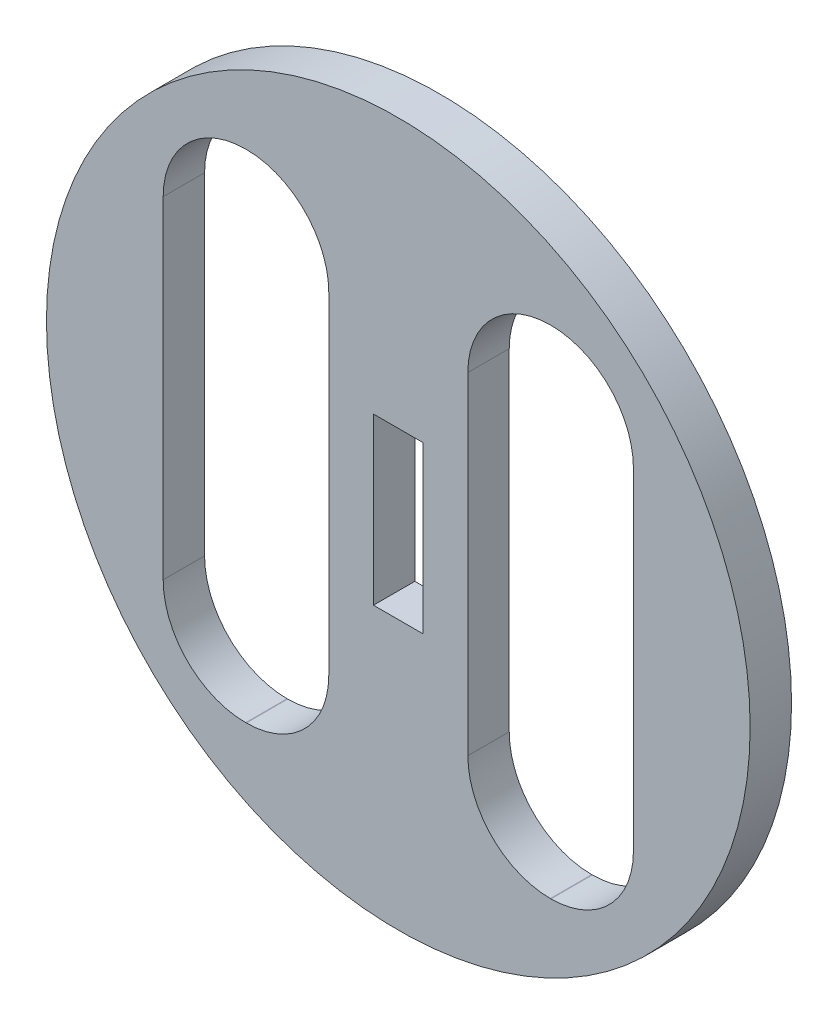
from build123d import *

# Parameters (mm, degrees)
SKETCH1_R          = 26.9875
EXTRUDE1_DEPTH     = 3.175
CUT_EXTRUDE1_DEPTH = 39.29792341
SKETCH3_W          = 3.81
SKETCH3_H          = 12.7
CUT_EXTRUDE2_DEPTH = 39.29792341


with BuildPart() as part:
    # Sketch1 → Extrude1 (new body)
    with BuildSketch(Plane.XY):
        Circle(SKETCH1_R)
    extrude(amount=EXTRUDE1_DEPTH)

    # Sketch2 → Cut-Extrude1 (cut, through all)
    with BuildSketch(Plane.XY):
        with BuildLine():
            Line((-11.7094, 19.05), (-11.6586, 19.05))
            ThreePointArc((-11.6586, 19.05), (-7.186432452, 17.197567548), (-5.334, 12.7254))
            Line((-5.334, 12.7254), (-5.334, -12.7254))
            ThreePointArc((-5.334, -12.7254), (-7.186432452, -17.197567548), (-11.6586, -19.05))
            Line((-11.6586, -19.05), (-11.7094, -19.05))
            ThreePointArc((-11.7094, -19.05), (-16.181567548, -17.197567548), (-18.034, -12.7254))
            Line((-18.034, -12.7254), (-18.034, 12.7254))
            ThreePointArc((-18.034, 12.7254), (-16.181567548, 17.197567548), (-11.7094, 19.05))
        make_face()
        with BuildLine():
            Line((11.6586, 19.05), (11.7094, 19.05))
            ThreePointArc((11.7094, 19.05), (16.181567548, 17.197567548), (18.034, 12.7254))
            Line((18.034, 12.7254), (18.034, -12.7254))
            ThreePointArc((18.034, -12.7254), (16.181567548, -17.197567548), (11.7094, -19.05))
            Line((11.7094, -19.05), (11.6586, -19.05))
            ThreePointArc((11.6586, -19.05), (7.186432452, -17.197567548), (5.334, -12.7254))
            Line((5.334, -12.7254), (5.334, 12.7254))
            ThreePointArc((5.334, 12.7254), (7.186432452, 17.197567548), (11.6586, 19.05))
        make_face()
    extrude(amount=CUT_EXTRUDE1_DEPTH, mode=Mode.SUBTRACT)

    # Sketch3 → Cut-Extrude2 (cut, through all)
    with BuildSketch(Plane.XY):
        Rectangle(SKETCH3_W, SKETCH3_H)
    extrude(amount=CUT_EXTRUDE2_DEPTH, mode=Mode.SUBTRACT)


solid = part.part
